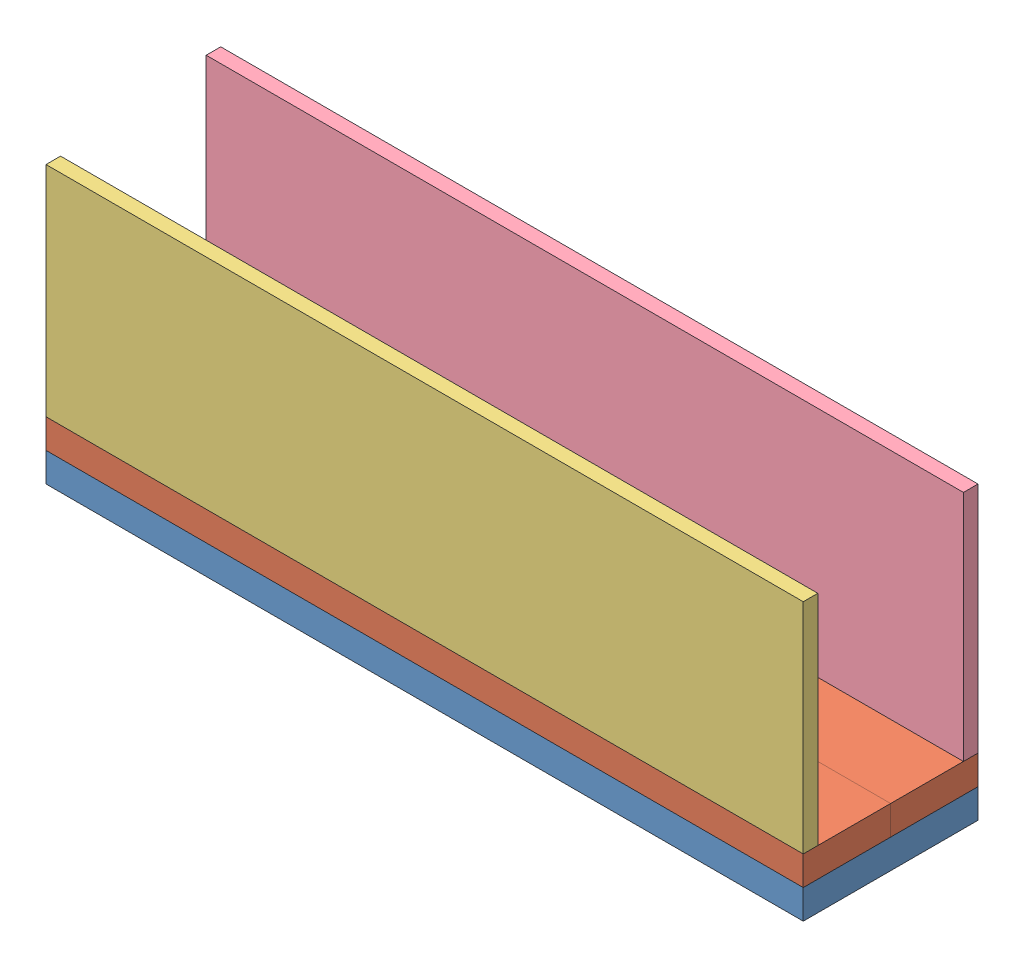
SolidWorks assembly Reflectance Array Mount.SLDASM, configuration Default (file format 13000). Lengths in mm.
Overall size (82.55 31.75 19.05).
7 component instances, 4 part files, 6 mates.
Components (placement in the parent):
- Bottom Layer Assembly-1: Bottom Layer Assembly.SLDASM [Default] at (35.9844 38.2841 63.8934) size (82.55 6.35 19.05)
  - Bottom Cardboard-1: Bottom Cardboard.SLDPRT [Default] at (-7.9927 45.8733 81.9435) size (82.55 3.17 19.05)
  - Popsicle Stick Assembly-1: Popsicle Stick Assembly.SLDASM [Default] at (-8.2221 -4.1441 -0.2138) size (82.55 3.17 19.05)
    - Cut Popsicle Stick-1: Cut Popsicle Stick.SLDPRT [Default] at (0.2294 53.1924 72.6323) size (82.55 3.17 9.53)
    - Cut Popsicle Stick-2: Cut Popsicle Stick.SLDPRT [Default] at (0.2294 53.1924 82.1573) size (82.55 3.17 9.53)
- 15_16 Cardboard Side-1: 15_16 Cardboard Side.SLDPRT [Default] at (27.9916 90.5074 144.2493) size (82.55 23.81 1.59)
- 1inch Cardboard Side-1: 1inch Cardboard Side.SLDPRT [Default] at (27.9916 90.5074 126.7868) size (82.55 25.4 1.59)
Mates (geometry in assembly coordinates):
- Coincident1: coincident anti-aligned: plane of Bottom Layer Assembly-1/Popsicle Stick Assembly-1/Cut Popsicle Stick-2 through (27.9916 90.5074 145.8368) normal (0 1 0); plane of 15_16 Cardboard Side-1 through (27.9916 90.5074 145.8368) normal (0 -1 0)
- Coincident2: coincident aligned: plane of Bottom Layer Assembly-1/Popsicle Stick Assembly-1/Cut Popsicle Stick-2 through (110.5416 90.5074 145.8368) normal (1 0 0); plane of 15_16 Cardboard Side-1 through (110.5416 90.5074 145.8368) normal (1 0 0)
- Coincident3: coincident aligned: plane of Bottom Layer Assembly-1/Popsicle Stick Assembly-1/Cut Popsicle Stick-2 through (27.9916 90.5074 145.8368) normal (0 0 1); plane of 15_16 Cardboard Side-1 through (27.9916 90.5074 145.8368) normal (0 0 1)
- Coincident4: coincident anti-aligned: plane of Bottom Layer Assembly-1/Popsicle Stick Assembly-1/Cut Popsicle Stick-1 through (27.9916 90.5074 136.3118) normal (0 1 0); plane of 1inch Cardboard Side-1 through (27.9916 90.5074 128.3743) normal (0 -1 0)
- Coincident5: coincident aligned: plane of Bottom Layer Assembly-1/Popsicle Stick Assembly-1/Cut Popsicle Stick-1 through (110.5416 90.5074 136.3118) normal (1 0 0); plane of 1inch Cardboard Side-1 through (110.5416 90.5074 128.3743) normal (1 0 0)
- Coincident6: coincident aligned: plane of Bottom Layer Assembly-1/Popsicle Stick Assembly-1/Cut Popsicle Stick-1 through (27.9916 90.5074 126.7868) normal (0 0 -1); plane of 1inch Cardboard Side-1 through (27.9916 90.5074 126.7868) normal (0 0 -1)
